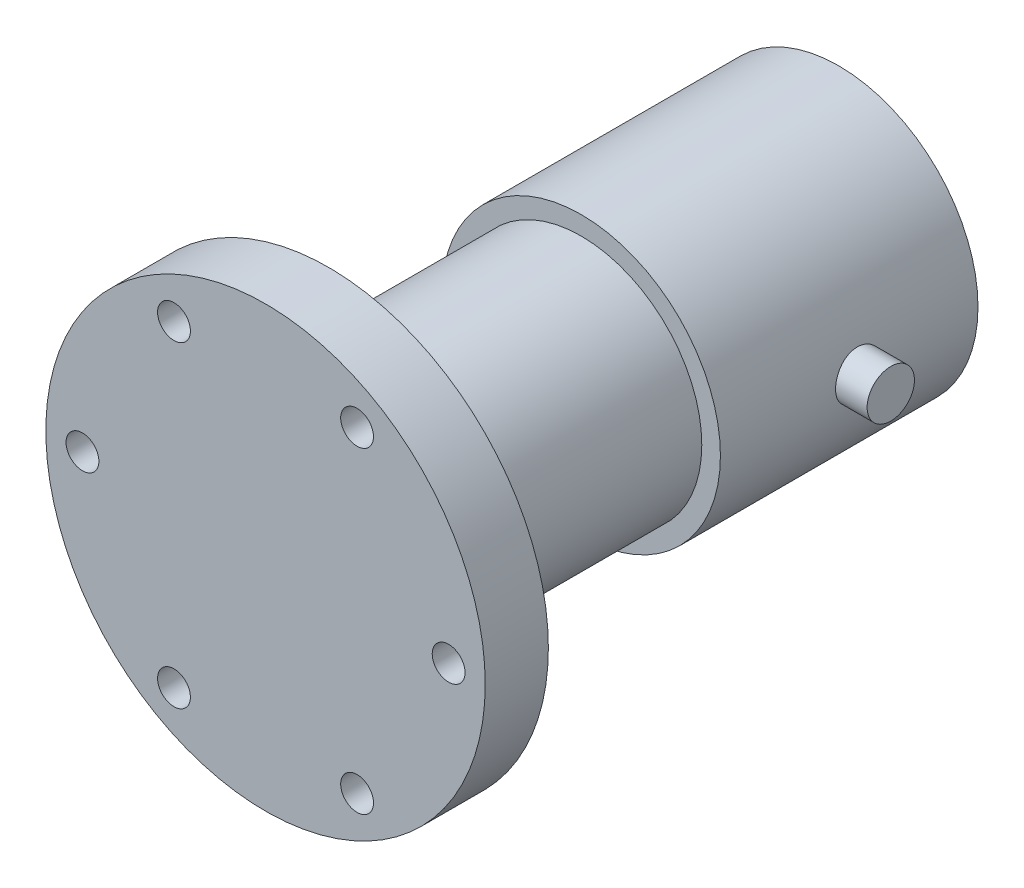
ISO-10303-21;
HEADER;
FILE_DESCRIPTION(('STEP AP214'),'2;1');
FILE_NAME('part.step','',(''),(''),'','','');
FILE_SCHEMA(('AUTOMOTIVE_DESIGN { 1 0 10303 214 1 1 1 1 }'));
ENDSEC;
DATA;
#1=APPLICATION_CONTEXT('core data for automotive mechanical design processes');
#2=APPLICATION_PROTOCOL_DEFINITION('international standard','automotive_design',2000,#1);
#3=PRODUCT_CONTEXT('',#1,'mechanical');
#4=PRODUCT('Part','Part','',(#3));
#5=PRODUCT_RELATED_PRODUCT_CATEGORY('part','',(#4));
#6=PRODUCT_DEFINITION_FORMATION('','',#4);
#7=PRODUCT_DEFINITION_CONTEXT('part definition',#1,'design');
#8=PRODUCT_DEFINITION('design','',#6,#7);
#9=PRODUCT_DEFINITION_SHAPE('','',#8);
#10=(LENGTH_UNIT() NAMED_UNIT(*) SI_UNIT(.MILLI.,.METRE.));
#11=(NAMED_UNIT(*) PLANE_ANGLE_UNIT() SI_UNIT($,.RADIAN.));
#12=(NAMED_UNIT(*) SI_UNIT($,.STERADIAN.) SOLID_ANGLE_UNIT());
#13=UNCERTAINTY_MEASURE_WITH_UNIT(LENGTH_MEASURE(1.E-05),#10,'distance_accuracy_value','');
#14=(GEOMETRIC_REPRESENTATION_CONTEXT(3) GLOBAL_UNCERTAINTY_ASSIGNED_CONTEXT((#13)) GLOBAL_UNIT_ASSIGNED_CONTEXT((#10,
#11,#12)) REPRESENTATION_CONTEXT('',''));
#15=CARTESIAN_POINT('',(0.,0.,0.));
#16=DIRECTION('',(0.,0.,1.));
#17=DIRECTION('',(1.,0.,0.));
#18=AXIS2_PLACEMENT_3D('',#15,#16,#17);
#19=CARTESIAN_POINT('',(0.,0.,-115.316));
#20=DIRECTION('',(0.,0.,1.));
#21=DIRECTION('',(-1.,0.,0.));
#22=AXIS2_PLACEMENT_3D('',#19,#20,#21);
#23=CYLINDRICAL_SURFACE('',#22,28.0035);
#24=CARTESIAN_POINT('',(0.,0.,-63.5));
#25=DIRECTION('',(0.,0.,1.));
#26=DIRECTION('',(1.,0.,0.));
#27=AXIS2_PLACEMENT_3D('',#24,#25,#26);
#28=CIRCLE('',#27,28.0035);
#29=CARTESIAN_POINT('',(28.0035,0.,-63.5));
#30=VERTEX_POINT('',#29);
#31=EDGE_CURVE('E47',#30,#30,#28,.T.);
#32=ORIENTED_EDGE('',*,*,#31,.F.);
#33=EDGE_LOOP('',(#32));
#34=FACE_BOUND('',#33,.T.);
#35=CARTESIAN_POINT('',(0.,0.,-115.316));
#36=DIRECTION('',(0.,0.,1.));
#37=DIRECTION('',(1.,0.,0.));
#38=AXIS2_PLACEMENT_3D('',#35,#36,#37);
#39=CIRCLE('',#38,28.0035);
#40=CARTESIAN_POINT('',(28.0035,0.,-115.316));
#41=VERTEX_POINT('',#40);
#42=EDGE_CURVE('E43',#41,#41,#39,.T.);
#43=ORIENTED_EDGE('',*,*,#42,.T.);
#44=EDGE_LOOP('',(#43));
#45=FACE_BOUND('',#44,.T.);
#46=CARTESIAN_POINT('',(28.0035,0.,-96.18472));
#47=CARTESIAN_POINT('',(28.003495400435,-0.265459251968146,-96.1847094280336));
#48=CARTESIAN_POINT('',(27.9996861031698,-0.531061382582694,-96.1624501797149));
#49=CARTESIAN_POINT('',(27.9848569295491,-1.054810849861,-96.0740414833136));
#50=CARTESIAN_POINT('',(27.9738305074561,-1.3129511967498,-96.0078521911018));
#51=CARTESIAN_POINT('',(27.9458033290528,-1.81412421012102,-95.8336442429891));
#52=CARTESIAN_POINT('',(27.9288075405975,-2.05716924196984,-95.725660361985));
#53=CARTESIAN_POINT('',(27.8907083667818,-2.52166170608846,-95.4710207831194));
#54=CARTESIAN_POINT('',(27.8696054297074,-2.74311149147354,-95.3243693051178));
#55=CARTESIAN_POINT('',(27.8253953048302,-3.16035756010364,-94.9950077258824));
#56=CARTESIAN_POINT('',(27.8022719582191,-3.35590812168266,-94.81198847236));
#57=CARTESIAN_POINT('',(27.7567502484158,-3.71368171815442,-94.4157519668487));
#58=CARTESIAN_POINT('',(27.7343519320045,-3.87590260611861,-94.2025327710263));
#59=CARTESIAN_POINT('',(27.6926597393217,-4.16340259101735,-93.7502533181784));
#60=CARTESIAN_POINT('',(27.6733867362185,-4.28843761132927,-93.5110358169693));
#61=CARTESIAN_POINT('',(27.6403520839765,-4.49645549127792,-93.014610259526));
#62=CARTESIAN_POINT('',(27.626590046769,-4.57944131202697,-92.7574034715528));
#63=CARTESIAN_POINT('',(27.6062966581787,-4.70022866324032,-92.2349091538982));
#64=CARTESIAN_POINT('',(27.5996973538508,-4.73845510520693,-91.969722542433));
#65=CARTESIAN_POINT('',(27.5942711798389,-4.76995626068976,-91.4366234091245));
#66=CARTESIAN_POINT('',(27.5954437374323,-4.76323428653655,-91.1687110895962));
#67=CARTESIAN_POINT('',(27.6053667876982,-4.70537528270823,-90.6408058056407));
#68=CARTESIAN_POINT('',(27.6140356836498,-4.65471648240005,-90.3807586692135));
#69=CARTESIAN_POINT('',(27.6378468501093,-4.51117275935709,-89.8729093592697));
#70=CARTESIAN_POINT('',(27.6529893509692,-4.4182863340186,-89.6251076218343));
#71=CARTESIAN_POINT('',(27.6881292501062,-4.19244189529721,-89.1473566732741));
#72=CARTESIAN_POINT('',(27.708150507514,-4.05928615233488,-88.9175027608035));
#73=CARTESIAN_POINT('',(27.7507755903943,-3.75682318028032,-88.4832197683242));
#74=CARTESIAN_POINT('',(27.7733796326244,-3.5875129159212,-88.2787928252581));
#75=CARTESIAN_POINT('',(27.8189814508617,-3.21494559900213,-87.8983992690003));
#76=CARTESIAN_POINT('',(27.8419805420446,-3.01127842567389,-87.72283424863));
#77=CARTESIAN_POINT('',(27.8855114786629,-2.57716340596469,-87.4083092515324));
#78=CARTESIAN_POINT('',(27.9060433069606,-2.34671537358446,-87.2693495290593));
#79=CARTESIAN_POINT('',(27.9423572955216,-1.86519619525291,-87.0319396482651));
#80=CARTESIAN_POINT('',(27.9581351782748,-1.61410673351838,-86.9335259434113));
#81=CARTESIAN_POINT('',(27.9831294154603,-1.09863444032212,-86.7803795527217));
#82=CARTESIAN_POINT('',(27.9923463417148,-0.834252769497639,-86.7256430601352));
#83=CARTESIAN_POINT('',(28.0031030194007,-0.30316124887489,-86.6619515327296));
#84=CARTESIAN_POINT('',(28.0047351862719,-0.036519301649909,-86.6524453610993));
#85=CARTESIAN_POINT('',(28.0003918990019,0.494546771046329,-86.6780135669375));
#86=CARTESIAN_POINT('',(27.9944167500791,0.758970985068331,-86.7130861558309));
#87=CARTESIAN_POINT('',(27.9755874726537,1.27638607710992,-86.8263579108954));
#88=CARTESIAN_POINT('',(27.9627770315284,1.52943862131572,-86.9042832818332));
#89=CARTESIAN_POINT('',(27.9317077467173,2.0188878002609,-87.1007560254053));
#90=CARTESIAN_POINT('',(27.9134485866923,2.25528346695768,-87.2193057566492));
#91=CARTESIAN_POINT('',(27.873277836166,2.70709595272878,-87.4949176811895));
#92=CARTESIAN_POINT('',(27.8513342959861,2.92230057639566,-87.6523229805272));
#93=CARTESIAN_POINT('',(27.8063228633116,3.32343785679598,-88.0007071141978));
#94=CARTESIAN_POINT('',(27.7832548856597,3.50936829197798,-88.1916884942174));
#95=CARTESIAN_POINT('',(27.7382944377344,3.84873029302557,-88.6042791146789));
#96=CARTESIAN_POINT('',(27.7164173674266,4.0017888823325,-88.8261970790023));
#97=CARTESIAN_POINT('',(27.6766067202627,4.2684548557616,-89.2929182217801));
#98=CARTESIAN_POINT('',(27.6586730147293,4.38206352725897,-89.5377206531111));
#99=CARTESIAN_POINT('',(27.6288960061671,4.56605138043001,-90.0422337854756));
#100=CARTESIAN_POINT('',(27.6170269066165,4.63661391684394,-90.3018760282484));
#101=CARTESIAN_POINT('',(27.6006591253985,4.73308183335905,-90.8295471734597));
#102=CARTESIAN_POINT('',(27.5961597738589,4.75899127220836,-91.0975753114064));
#103=CARTESIAN_POINT('',(27.5950706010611,4.7653007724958,-91.630683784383));
#104=CARTESIAN_POINT('',(27.5983787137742,4.74628809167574,-91.8957571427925));
#105=CARTESIAN_POINT('',(27.6123076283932,4.66456536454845,-92.418874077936));
#106=CARTESIAN_POINT('',(27.6229284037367,4.60185547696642,-92.6769176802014));
#107=CARTESIAN_POINT('',(27.6502465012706,4.43474704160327,-93.1784092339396));
#108=CARTESIAN_POINT('',(27.6669361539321,4.33040109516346,-93.4218751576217));
#109=CARTESIAN_POINT('',(27.7045185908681,4.08304341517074,-93.887940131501));
#110=CARTESIAN_POINT('',(27.7254115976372,3.94002963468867,-94.1105380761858));
#111=CARTESIAN_POINT('',(27.7693691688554,3.61730844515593,-94.531511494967));
#112=CARTESIAN_POINT('',(27.7924573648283,3.43716969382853,-94.7295538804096));
#113=CARTESIAN_POINT('',(27.8380172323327,3.0462202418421,-95.0927998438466));
#114=CARTESIAN_POINT('',(27.8604887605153,2.83540248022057,-95.2579958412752));
#115=CARTESIAN_POINT('',(27.9024718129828,2.38726724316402,-95.5519541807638));
#116=CARTESIAN_POINT('',(27.9219607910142,2.14976940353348,-95.680444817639));
#117=CARTESIAN_POINT('',(27.9555634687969,1.65632204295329,-95.8955066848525));
#118=CARTESIAN_POINT('',(27.969682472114,1.4003910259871,-95.9821192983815));
#119=CARTESIAN_POINT('',(27.9879045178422,0.952917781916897,-96.0923542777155));
#120=CARTESIAN_POINT('',(27.9937212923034,0.7640693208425,-96.1269353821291));
#121=CARTESIAN_POINT('',(28.0015206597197,0.383505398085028,-96.1731218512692));
#122=CARTESIAN_POINT('',(28.0035033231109,0.19178998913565,-96.1847276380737));
#123=CARTESIAN_POINT('',(28.0035,0.,-96.18472));
#124=B_SPLINE_CURVE_WITH_KNOTS('',3,(#46,#47,#48,#49,#50,#51,#52,#53,#54,#55,#56,#57,#58,#59,
#60,#61,#62,#63,#64,#65,#66,#67,#68,#69,#70,#71,#72,#73,#74,#75,#76,#77,#78,#79,#80,#81,#82,#83,
#84,#85,#86,#87,#88,#89,#90,#91,#92,#93,#94,#95,#96,#97,#98,#99,#100,#101,#102,#103,#104,#105,
#106,#107,#108,#109,#110,#111,#112,#113,#114,#115,#116,#117,#118,#119,#120,#121,#122,#123),
.UNSPECIFIED.,.T.,.F.,(4,2,2,2,2,2,2,2,2,2,2,2,2,2,2,2,2,2,2,2,2,2,2,2,2,2,2,2,2,2,2,2,2,2,2,2,
2,2,4),(0.,0.795676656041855,1.59207597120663,2.38781406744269,3.18346535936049,3.9861943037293,
4.78897493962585,5.59691403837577,6.40479623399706,7.20494517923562,8.00503516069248,
8.79652434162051,9.58804168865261,10.3835104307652,11.1790459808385,11.9848542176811,
12.7906680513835,13.5972047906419,14.4036712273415,15.2002851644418,15.996867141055,
16.788417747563,17.5800143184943,18.3788679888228,19.1777822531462,19.9853313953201,
20.7928541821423,21.5969128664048,22.4008984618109,23.1944319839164,23.9879626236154,
24.7804939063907,25.5730671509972,26.3754284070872,27.1779746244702,27.9863161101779,
28.7938571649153,29.3687311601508,29.9435945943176),.UNSPECIFIED.);
#125=CARTESIAN_POINT('',(28.0035,0.,-96.18472));
#126=VERTEX_POINT('',#125);
#127=EDGE_CURVE('E11',#126,#126,#124,.T.);
#128=ORIENTED_EDGE('',*,*,#127,.T.);
#129=EDGE_LOOP('',(#128));
#130=FACE_BOUND('',#129,.T.);
#131=ADVANCED_FACE('F33',(#34,#45,#130),#23,.T.);
#132=CARTESIAN_POINT('',(0.,0.,-115.316));
#133=DIRECTION('',(0.,0.,-1.));
#134=DIRECTION('',(1.,0.,0.));
#135=AXIS2_PLACEMENT_3D('',#132,#133,#134);
#136=PLANE('',#135);
#137=CARTESIAN_POINT('',(0.,0.,-115.316));
#138=DIRECTION('',(0.,0.,1.));
#139=DIRECTION('',(1.,0.,0.));
#140=AXIS2_PLACEMENT_3D('',#137,#138,#139);
#141=CIRCLE('',#140,22.5425);
#142=CARTESIAN_POINT('',(22.5425,0.,-115.316));
#143=VERTEX_POINT('',#142);
#144=EDGE_CURVE('E56',#143,#143,#141,.T.);
#145=ORIENTED_EDGE('',*,*,#144,.T.);
#146=EDGE_LOOP('',(#145));
#147=FACE_BOUND('',#146,.T.);
#148=ORIENTED_EDGE('',*,*,#42,.F.);
#149=EDGE_LOOP('',(#148));
#150=FACE_BOUND('',#149,.T.);
#151=ADVANCED_FACE('F78',(#147,#150),#136,.T.);
#152=CARTESIAN_POINT('',(0.,0.,-63.5));
#153=DIRECTION('',(0.,0.,-1.));
#154=DIRECTION('',(1.,0.,0.));
#155=AXIS2_PLACEMENT_3D('',#152,#153,#154);
#156=PLANE('',#155);
#157=CARTESIAN_POINT('',(0.,0.,-63.5));
#158=DIRECTION('',(0.,0.,1.));
#159=DIRECTION('',(1.,0.,0.));
#160=AXIS2_PLACEMENT_3D('',#157,#158,#159);
#161=CIRCLE('',#160,22.5425);
#162=CARTESIAN_POINT('',(22.5425,0.,-63.5));
#163=VERTEX_POINT('',#162);
#164=EDGE_CURVE('E52',#163,#163,#161,.T.);
#165=ORIENTED_EDGE('',*,*,#164,.F.);
#166=EDGE_LOOP('',(#165));
#167=FACE_BOUND('',#166,.T.);
#168=ORIENTED_EDGE('',*,*,#31,.T.);
#169=EDGE_LOOP('',(#168));
#170=FACE_BOUND('',#169,.T.);
#171=ADVANCED_FACE('F83',(#167,#170),#156,.F.);
#172=CARTESIAN_POINT('',(0.,0.,-61.976));
#173=DIRECTION('',(0.,0.,-1.));
#174=DIRECTION('',(1.,0.,0.));
#175=AXIS2_PLACEMENT_3D('',#172,#173,#174);
#176=CYLINDRICAL_SURFACE('',#175,22.5425);
#177=ORIENTED_EDGE('',*,*,#144,.F.);
#178=EDGE_LOOP('',(#177));
#179=FACE_BOUND('',#178,.T.);
#180=ORIENTED_EDGE('',*,*,#164,.T.);
#181=EDGE_LOOP('',(#180));
#182=FACE_BOUND('',#181,.T.);
#183=ADVANCED_FACE('F76',(#179,#182),#176,.F.);
#184=CARTESIAN_POINT('',(34.3535,0.,-91.42222));
#185=DIRECTION('',(-1.,0.,0.));
#186=DIRECTION('',(0.,0.,-1.));
#187=AXIS2_PLACEMENT_3D('',#184,#185,#186);
#188=CYLINDRICAL_SURFACE('',#187,4.7625);
#189=CARTESIAN_POINT('',(34.3535,0.,-91.42222));
#190=DIRECTION('',(-1.,0.,0.));
#191=DIRECTION('',(0.,0.,1.));
#192=AXIS2_PLACEMENT_3D('',#189,#190,#191);
#193=CIRCLE('',#192,4.7625);
#194=CARTESIAN_POINT('',(34.3535,0.,-86.65972));
#195=VERTEX_POINT('',#194);
#196=EDGE_CURVE('E60',#195,#195,#193,.T.);
#197=ORIENTED_EDGE('',*,*,#196,.T.);
#198=EDGE_LOOP('',(#197));
#199=FACE_BOUND('',#198,.T.);
#200=ORIENTED_EDGE('',*,*,#127,.F.);
#201=EDGE_LOOP('',(#200));
#202=FACE_BOUND('',#201,.T.);
#203=ADVANCED_FACE('F67',(#199,#202),#188,.T.);
#204=CARTESIAN_POINT('',(34.3535,0.,-91.42222));
#205=DIRECTION('',(1.,0.,0.));
#206=DIRECTION('',(0.,0.,1.));
#207=AXIS2_PLACEMENT_3D('',#204,#205,#206);
#208=PLANE('',#207);
#209=ORIENTED_EDGE('',*,*,#196,.F.);
#210=EDGE_LOOP('',(#209));
#211=FACE_BOUND('',#210,.T.);
#212=ADVANCED_FACE('F70',(#211),#208,.T.);
#213=CLOSED_SHELL('',(#131,#151,#171,#183,#203,#212));
#214=MANIFOLD_SOLID_BREP('B2',#213);
#215=CARTESIAN_POINT('',(0.,0.,-12.7));
#216=DIRECTION('',(0.,0.,1.));
#217=DIRECTION('',(-1.,0.,0.));
#218=AXIS2_PLACEMENT_3D('',#215,#216,#217);
#219=CYLINDRICAL_SURFACE('',#218,44.196);
#220=CARTESIAN_POINT('',(0.,0.,-12.7));
#221=DIRECTION('',(0.,0.,1.));
#222=DIRECTION('',(1.,0.,0.));
#223=AXIS2_PLACEMENT_3D('',#220,#221,#222);
#224=CIRCLE('',#223,44.196);
#225=CARTESIAN_POINT('',(44.196,0.,-12.7));
#226=VERTEX_POINT('',#225);
#227=EDGE_CURVE('E32',#226,#226,#224,.T.);
#228=ORIENTED_EDGE('',*,*,#227,.T.);
#229=EDGE_LOOP('',(#228));
#230=FACE_BOUND('',#229,.T.);
#231=CARTESIAN_POINT('',(0.,0.,0.));
#232=DIRECTION('',(0.,0.,1.));
#233=DIRECTION('',(1.,0.,0.));
#234=AXIS2_PLACEMENT_3D('',#231,#232,#233);
#235=CIRCLE('',#234,44.196);
#236=CARTESIAN_POINT('',(44.196,0.,0.));
#237=VERTEX_POINT('',#236);
#238=EDGE_CURVE('E129',#237,#237,#235,.T.);
#239=ORIENTED_EDGE('',*,*,#238,.F.);
#240=EDGE_LOOP('',(#239));
#241=FACE_BOUND('',#240,.T.);
#242=ADVANCED_FACE('F123',(#230,#241),#219,.T.);
#243=CARTESIAN_POINT('',(0.,0.,-12.7));
#244=DIRECTION('',(0.,0.,-1.));
#245=DIRECTION('',(1.,0.,0.));
#246=AXIS2_PLACEMENT_3D('',#243,#244,#245);
#247=PLANE('',#246);
#248=CARTESIAN_POINT('',(18.4150000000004,31.8957156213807,-12.7));
#249=DIRECTION('',(0.,0.,-1.));
#250=DIRECTION('',(-0.50000000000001,-0.866025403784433,0.));
#251=AXIS2_PLACEMENT_3D('',#248,#249,#250);
#252=CIRCLE('',#251,3.302);
#253=CARTESIAN_POINT('',(16.7640000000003,29.0360997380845,-12.7));
#254=VERTEX_POINT('',#253);
#255=EDGE_CURVE('E166',#254,#254,#252,.T.);
#256=ORIENTED_EDGE('',*,*,#255,.F.);
#257=EDGE_LOOP('',(#256));
#258=FACE_BOUND('',#257,.T.);
#259=CARTESIAN_POINT('',(-18.4149999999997,31.895715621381,-12.7));
#260=DIRECTION('',(0.,0.,-1.));
#261=DIRECTION('',(0.499999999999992,-0.866025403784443,0.));
#262=AXIS2_PLACEMENT_3D('',#259,#260,#261);
#263=CIRCLE('',#262,3.302);
#264=CARTESIAN_POINT('',(-16.7639999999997,29.0360997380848,-12.7));
#265=VERTEX_POINT('',#264);
#266=EDGE_CURVE('E160',#265,#265,#263,.T.);
#267=ORIENTED_EDGE('',*,*,#266,.F.);
#268=EDGE_LOOP('',(#267));
#269=FACE_BOUND('',#268,.T.);
#270=CARTESIAN_POINT('',(-36.83,2.57182664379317E-13,-12.7));
#271=DIRECTION('',(0.,0.,-1.));
#272=DIRECTION('',(1.,0.,0.));
#273=AXIS2_PLACEMENT_3D('',#270,#271,#272);
#274=CIRCLE('',#273,3.302);
#275=CARTESIAN_POINT('',(-33.528,2.34124908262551E-13,-12.7));
#276=VERTEX_POINT('',#275);
#277=EDGE_CURVE('E154',#276,#276,#274,.T.);
#278=ORIENTED_EDGE('',*,*,#277,.F.);
#279=EDGE_LOOP('',(#278));
#280=FACE_BOUND('',#279,.T.);
#281=CARTESIAN_POINT('',(-18.4150000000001,-31.8957156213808,-12.7));
#282=DIRECTION('',(0.,0.,-1.));
#283=DIRECTION('',(0.500000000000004,0.866025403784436,0.));
#284=AXIS2_PLACEMENT_3D('',#281,#282,#283);
#285=CIRCLE('',#284,3.302);
#286=CARTESIAN_POINT('',(-16.7640000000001,-29.0360997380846,-12.7));
#287=VERTEX_POINT('',#286);
#288=EDGE_CURVE('E148',#287,#287,#285,.T.);
#289=ORIENTED_EDGE('',*,*,#288,.F.);
#290=EDGE_LOOP('',(#289));
#291=FACE_BOUND('',#290,.T.);
#292=CARTESIAN_POINT('',(18.4149999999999,-31.8957156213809,-12.7));
#293=DIRECTION('',(0.,0.,-1.));
#294=DIRECTION('',(-0.499999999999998,0.86602540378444,0.));
#295=AXIS2_PLACEMENT_3D('',#292,#293,#294);
#296=CIRCLE('',#295,3.302);
#297=CARTESIAN_POINT('',(16.7639999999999,-29.0360997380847,-12.7));
#298=VERTEX_POINT('',#297);
#299=EDGE_CURVE('E142',#298,#298,#296,.T.);
#300=ORIENTED_EDGE('',*,*,#299,.F.);
#301=EDGE_LOOP('',(#300));
#302=FACE_BOUND('',#301,.T.);
#303=CARTESIAN_POINT('',(36.83,0.,-12.7));
#304=DIRECTION('',(0.,0.,1.));
#305=DIRECTION('',(1.,0.,0.));
#306=AXIS2_PLACEMENT_3D('',#303,#304,#305);
#307=CIRCLE('',#306,3.302);
#308=CARTESIAN_POINT('',(33.528,0.,-12.7));
#309=VERTEX_POINT('',#308);
#310=EDGE_CURVE('E133',#309,#309,#307,.T.);
#311=ORIENTED_EDGE('',*,*,#310,.T.);
#312=EDGE_LOOP('',(#311));
#313=FACE_BOUND('',#312,.T.);
#314=ORIENTED_EDGE('',*,*,#227,.F.);
#315=EDGE_LOOP('',(#314));
#316=FACE_BOUND('',#315,.T.);
#317=ADVANCED_FACE('F188',(#258,#269,#280,#291,#302,#313,#316),#247,.T.);
#318=CARTESIAN_POINT('',(0.,0.,0.));
#319=DIRECTION('',(0.,0.,-1.));
#320=DIRECTION('',(1.,0.,0.));
#321=AXIS2_PLACEMENT_3D('',#318,#319,#320);
#322=PLANE('',#321);
#323=CARTESIAN_POINT('',(18.4150000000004,31.8957156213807,0.));
#324=DIRECTION('',(0.,0.,-1.));
#325=DIRECTION('',(-0.50000000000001,-0.866025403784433,0.));
#326=AXIS2_PLACEMENT_3D('',#323,#324,#325);
#327=CIRCLE('',#326,3.302);
#328=CARTESIAN_POINT('',(16.7640000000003,29.0360997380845,0.));
#329=VERTEX_POINT('',#328);
#330=EDGE_CURVE('E169',#329,#329,#327,.T.);
#331=ORIENTED_EDGE('',*,*,#330,.T.);
#332=EDGE_LOOP('',(#331));
#333=FACE_BOUND('',#332,.T.);
#334=CARTESIAN_POINT('',(-18.4149999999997,31.895715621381,0.));
#335=DIRECTION('',(0.,0.,-1.));
#336=DIRECTION('',(0.499999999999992,-0.866025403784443,0.));
#337=AXIS2_PLACEMENT_3D('',#334,#335,#336);
#338=CIRCLE('',#337,3.302);
#339=CARTESIAN_POINT('',(-16.7639999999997,29.0360997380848,0.));
#340=VERTEX_POINT('',#339);
#341=EDGE_CURVE('E163',#340,#340,#338,.T.);
#342=ORIENTED_EDGE('',*,*,#341,.T.);
#343=EDGE_LOOP('',(#342));
#344=FACE_BOUND('',#343,.T.);
#345=CARTESIAN_POINT('',(-36.83,2.57182664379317E-13,0.));
#346=DIRECTION('',(0.,0.,-1.));
#347=DIRECTION('',(1.,0.,0.));
#348=AXIS2_PLACEMENT_3D('',#345,#346,#347);
#349=CIRCLE('',#348,3.302);
#350=CARTESIAN_POINT('',(-33.528,2.34124908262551E-13,0.));
#351=VERTEX_POINT('',#350);
#352=EDGE_CURVE('E157',#351,#351,#349,.T.);
#353=ORIENTED_EDGE('',*,*,#352,.T.);
#354=EDGE_LOOP('',(#353));
#355=FACE_BOUND('',#354,.T.);
#356=CARTESIAN_POINT('',(-18.4150000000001,-31.8957156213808,0.));
#357=DIRECTION('',(0.,0.,-1.));
#358=DIRECTION('',(0.500000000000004,0.866025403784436,0.));
#359=AXIS2_PLACEMENT_3D('',#356,#357,#358);
#360=CIRCLE('',#359,3.302);
#361=CARTESIAN_POINT('',(-16.7640000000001,-29.0360997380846,0.));
#362=VERTEX_POINT('',#361);
#363=EDGE_CURVE('E151',#362,#362,#360,.T.);
#364=ORIENTED_EDGE('',*,*,#363,.T.);
#365=EDGE_LOOP('',(#364));
#366=FACE_BOUND('',#365,.T.);
#367=CARTESIAN_POINT('',(18.4149999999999,-31.8957156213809,0.));
#368=DIRECTION('',(0.,0.,-1.));
#369=DIRECTION('',(-0.499999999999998,0.86602540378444,0.));
#370=AXIS2_PLACEMENT_3D('',#367,#368,#369);
#371=CIRCLE('',#370,3.302);
#372=CARTESIAN_POINT('',(16.7639999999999,-29.0360997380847,0.));
#373=VERTEX_POINT('',#372);
#374=EDGE_CURVE('E145',#373,#373,#371,.T.);
#375=ORIENTED_EDGE('',*,*,#374,.T.);
#376=EDGE_LOOP('',(#375));
#377=FACE_BOUND('',#376,.T.);
#378=CARTESIAN_POINT('',(36.83,0.,0.));
#379=DIRECTION('',(0.,0.,-1.));
#380=DIRECTION('',(-1.,0.,0.));
#381=AXIS2_PLACEMENT_3D('',#378,#379,#380);
#382=CIRCLE('',#381,3.302);
#383=CARTESIAN_POINT('',(33.528,0.,0.));
#384=VERTEX_POINT('',#383);
#385=EDGE_CURVE('E137',#384,#384,#382,.T.);
#386=ORIENTED_EDGE('',*,*,#385,.T.);
#387=EDGE_LOOP('',(#386));
#388=FACE_BOUND('',#387,.T.);
#389=ORIENTED_EDGE('',*,*,#238,.T.);
#390=EDGE_LOOP('',(#389));
#391=FACE_BOUND('',#390,.T.);
#392=ADVANCED_FACE('F173',(#333,#344,#355,#366,#377,#388,#391),#322,.F.);
#393=CARTESIAN_POINT('',(36.83,0.,-115.316));
#394=DIRECTION('',(0.,0.,1.));
#395=DIRECTION('',(-1.,0.,0.));
#396=AXIS2_PLACEMENT_3D('',#393,#394,#395);
#397=CYLINDRICAL_SURFACE('',#396,3.302);
#398=CARTESIAN_POINT('',(33.528,0.,-12.7));
#399=CARTESIAN_POINT('',(33.528,0.,-12.5677083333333));
#400=CARTESIAN_POINT('',(33.528,0.,-12.4354166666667));
#401=CARTESIAN_POINT('',(33.528,0.,-12.1708333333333));
#402=CARTESIAN_POINT('',(33.528,0.,-12.0385416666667));
#403=CARTESIAN_POINT('',(33.528,0.,-11.7739583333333));
#404=CARTESIAN_POINT('',(33.528,0.,-11.6416666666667));
#405=CARTESIAN_POINT('',(33.528,0.,-11.3770833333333));
#406=CARTESIAN_POINT('',(33.528,0.,-11.2447916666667));
#407=CARTESIAN_POINT('',(33.528,0.,-10.9802083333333));
#408=CARTESIAN_POINT('',(33.528,0.,-10.8479166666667));
#409=CARTESIAN_POINT('',(33.528,0.,-10.5833333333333));
#410=CARTESIAN_POINT('',(33.528,0.,-10.4510416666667));
#411=CARTESIAN_POINT('',(33.528,0.,-10.1864583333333));
#412=CARTESIAN_POINT('',(33.528,0.,-10.0541666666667));
#413=CARTESIAN_POINT('',(33.528,0.,-9.78958333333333));
#414=CARTESIAN_POINT('',(33.528,0.,-9.65729166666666));
#415=CARTESIAN_POINT('',(33.528,0.,-9.39270833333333));
#416=CARTESIAN_POINT('',(33.528,0.,-9.26041666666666));
#417=CARTESIAN_POINT('',(33.528,0.,-8.99583333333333));
#418=CARTESIAN_POINT('',(33.528,0.,-8.86354166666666));
#419=CARTESIAN_POINT('',(33.528,0.,-8.59895833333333));
#420=CARTESIAN_POINT('',(33.528,0.,-8.46666666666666));
#421=CARTESIAN_POINT('',(33.528,0.,-8.20208333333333));
#422=CARTESIAN_POINT('',(33.528,0.,-8.06979166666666));
#423=CARTESIAN_POINT('',(33.528,0.,-7.80520833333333));
#424=CARTESIAN_POINT('',(33.528,0.,-7.67291666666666));
#425=CARTESIAN_POINT('',(33.528,0.,-7.40833333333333));
#426=CARTESIAN_POINT('',(33.528,0.,-7.27604166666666));
#427=CARTESIAN_POINT('',(33.528,0.,-7.01145833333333));
#428=CARTESIAN_POINT('',(33.528,0.,-6.87916666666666));
#429=CARTESIAN_POINT('',(33.528,0.,-6.61458333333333));
#430=CARTESIAN_POINT('',(33.528,0.,-6.48229166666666));
#431=CARTESIAN_POINT('',(33.528,0.,-6.21770833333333));
#432=CARTESIAN_POINT('',(33.528,0.,-6.08541666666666));
#433=CARTESIAN_POINT('',(33.528,0.,-5.82083333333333));
#434=CARTESIAN_POINT('',(33.528,0.,-5.68854166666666));
#435=CARTESIAN_POINT('',(33.528,0.,-5.42395833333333));
#436=CARTESIAN_POINT('',(33.528,0.,-5.29166666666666));
#437=CARTESIAN_POINT('',(33.528,0.,-5.02708333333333));
#438=CARTESIAN_POINT('',(33.528,0.,-4.89479166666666));
#439=CARTESIAN_POINT('',(33.528,0.,-4.63020833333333));
#440=CARTESIAN_POINT('',(33.528,0.,-4.49791666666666));
#441=CARTESIAN_POINT('',(33.528,0.,-4.23333333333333));
#442=CARTESIAN_POINT('',(33.528,0.,-4.10104166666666));
#443=CARTESIAN_POINT('',(33.528,0.,-3.83645833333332));
#444=CARTESIAN_POINT('',(33.528,0.,-3.70416666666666));
#445=CARTESIAN_POINT('',(33.528,0.,-3.43958333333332));
#446=CARTESIAN_POINT('',(33.528,0.,-3.30729166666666));
#447=CARTESIAN_POINT('',(33.528,0.,-3.04270833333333));
#448=CARTESIAN_POINT('',(33.528,0.,-2.91041666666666));
#449=CARTESIAN_POINT('',(33.528,0.,-2.64583333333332));
#450=CARTESIAN_POINT('',(33.528,0.,-2.51354166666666));
#451=CARTESIAN_POINT('',(33.528,0.,-2.24895833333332));
#452=CARTESIAN_POINT('',(33.528,0.,-2.11666666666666));
#453=CARTESIAN_POINT('',(33.528,0.,-1.85208333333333));
#454=CARTESIAN_POINT('',(33.528,0.,-1.71979166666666));
#455=CARTESIAN_POINT('',(33.528,0.,-1.45520833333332));
#456=CARTESIAN_POINT('',(33.528,0.,-1.32291666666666));
#457=CARTESIAN_POINT('',(33.528,0.,-1.05833333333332));
#458=CARTESIAN_POINT('',(33.528,0.,-0.92604166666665));
#459=CARTESIAN_POINT('',(33.528,0.,-0.661458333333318));
#460=CARTESIAN_POINT('',(33.528,0.,-0.529166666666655));
#461=CARTESIAN_POINT('',(33.528,0.,-0.264583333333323));
#462=CARTESIAN_POINT('',(33.528,0.,-0.132291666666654));
#463=CARTESIAN_POINT('',(33.528,0.,0.));
#464=B_SPLINE_CURVE_WITH_KNOTS('',3,(#398,#399,#400,#401,#402,#403,#404,#405,#406,#407,#408,
#409,#410,#411,#412,#413,#414,#415,#416,#417,#418,#419,#420,#421,#422,#423,#424,#425,#426,#427,
#428,#429,#430,#431,#432,#433,#434,#435,#436,#437,#438,#439,#440,#441,#442,#443,#444,#445,#446,
#447,#448,#449,#450,#451,#452,#453,#454,#455,#456,#457,#458,#459,#460,#461,#462,#463),
.UNSPECIFIED.,.F.,.F.,(4,2,2,2,2,2,2,2,2,2,2,2,2,2,2,2,2,2,2,2,2,2,2,2,2,2,2,2,2,2,2,2,4),(0.,
0.396875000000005,0.793749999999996,1.190625,1.58750000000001,1.984375,2.38125,2.77812500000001,
3.17500000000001,3.571875,3.96875000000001,4.36562500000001,4.7625,5.15937500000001,
5.55625000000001,5.953125,6.35000000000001,6.74687500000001,7.14375,7.54062500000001,
7.93750000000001,8.334375,8.73125000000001,9.12812500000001,9.52500000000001,9.92187500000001,
10.31875,10.715625,11.1125,11.509375,11.90625,12.303125,12.7),.UNSPECIFIED.);
#465=EDGE_CURVE('BSEAM197',#309,#384,#464,.T.);
#466=ORIENTED_EDGE('',*,*,#310,.F.);
#467=ORIENTED_EDGE('',*,*,#385,.F.);
#468=ORIENTED_EDGE('',*,*,#465,.T.);
#469=ORIENTED_EDGE('',*,*,#465,.F.);
#470=EDGE_LOOP('',(#466,#468,#467,#469));
#471=FACE_BOUND('',#470,.T.);
#472=ADVANCED_FACE('F197',(#471),#397,.F.);
#473=CARTESIAN_POINT('',(18.4149999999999,-31.8957156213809,-12.7));
#474=DIRECTION('',(0.,0.,1.));
#475=DIRECTION('',(-1.,0.,0.));
#476=AXIS2_PLACEMENT_3D('',#473,#474,#475);
#477=CYLINDRICAL_SURFACE('',#476,3.302);
#478=ORIENTED_EDGE('',*,*,#299,.T.);
#479=EDGE_LOOP('',(#478));
#480=FACE_BOUND('',#479,.T.);
#481=ORIENTED_EDGE('',*,*,#374,.F.);
#482=EDGE_LOOP('',(#481));
#483=FACE_BOUND('',#482,.T.);
#484=ADVANCED_FACE('F204',(#480,#483),#477,.F.);
#485=CARTESIAN_POINT('',(-18.4150000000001,-31.8957156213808,-12.7));
#486=DIRECTION('',(0.,0.,1.));
#487=DIRECTION('',(-1.,0.,0.));
#488=AXIS2_PLACEMENT_3D('',#485,#486,#487);
#489=CYLINDRICAL_SURFACE('',#488,3.302);
#490=ORIENTED_EDGE('',*,*,#288,.T.);
#491=EDGE_LOOP('',(#490));
#492=FACE_BOUND('',#491,.T.);
#493=ORIENTED_EDGE('',*,*,#363,.F.);
#494=EDGE_LOOP('',(#493));
#495=FACE_BOUND('',#494,.T.);
#496=ADVANCED_FACE('F208',(#492,#495),#489,.F.);
#497=CARTESIAN_POINT('',(-36.83,2.57182664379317E-13,-12.7));
#498=DIRECTION('',(0.,0.,1.));
#499=DIRECTION('',(-1.,0.,0.));
#500=AXIS2_PLACEMENT_3D('',#497,#498,#499);
#501=CYLINDRICAL_SURFACE('',#500,3.302);
#502=ORIENTED_EDGE('',*,*,#277,.T.);
#503=EDGE_LOOP('',(#502));
#504=FACE_BOUND('',#503,.T.);
#505=ORIENTED_EDGE('',*,*,#352,.F.);
#506=EDGE_LOOP('',(#505));
#507=FACE_BOUND('',#506,.T.);
#508=ADVANCED_FACE('F184',(#504,#507),#501,.F.);
#509=CARTESIAN_POINT('',(-18.4149999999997,31.895715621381,-12.7));
#510=DIRECTION('',(0.,0.,1.));
#511=DIRECTION('',(-1.,0.,0.));
#512=AXIS2_PLACEMENT_3D('',#509,#510,#511);
#513=CYLINDRICAL_SURFACE('',#512,3.302);
#514=ORIENTED_EDGE('',*,*,#266,.T.);
#515=EDGE_LOOP('',(#514));
#516=FACE_BOUND('',#515,.T.);
#517=ORIENTED_EDGE('',*,*,#341,.F.);
#518=EDGE_LOOP('',(#517));
#519=FACE_BOUND('',#518,.T.);
#520=ADVANCED_FACE('F178',(#516,#519),#513,.F.);
#521=CARTESIAN_POINT('',(18.4150000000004,31.8957156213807,-12.7));
#522=DIRECTION('',(0.,0.,1.));
#523=DIRECTION('',(-1.,0.,0.));
#524=AXIS2_PLACEMENT_3D('',#521,#522,#523);
#525=CYLINDRICAL_SURFACE('',#524,3.302);
#526=ORIENTED_EDGE('',*,*,#255,.T.);
#527=EDGE_LOOP('',(#526));
#528=FACE_BOUND('',#527,.T.);
#529=ORIENTED_EDGE('',*,*,#330,.F.);
#530=EDGE_LOOP('',(#529));
#531=FACE_BOUND('',#530,.T.);
#532=ADVANCED_FACE('F176',(#528,#531),#525,.F.);
#533=CLOSED_SHELL('',(#242,#317,#392,#472,#484,#496,#508,#520,#532));
#534=MANIFOLD_SOLID_BREP('B6',#533);
#535=CARTESIAN_POINT('',(0.,0.,-63.5));
#536=DIRECTION('',(0.,0.,1.));
#537=DIRECTION('',(-1.,0.,0.));
#538=AXIS2_PLACEMENT_3D('',#535,#536,#537);
#539=CYLINDRICAL_SURFACE('',#538,24.257);
#540=CARTESIAN_POINT('',(0.,0.,-63.5));
#541=DIRECTION('',(0.,0.,1.));
#542=DIRECTION('',(1.,0.,0.));
#543=AXIS2_PLACEMENT_3D('',#540,#541,#542);
#544=CIRCLE('',#543,24.257);
#545=CARTESIAN_POINT('',(24.257,0.,-63.5));
#546=VERTEX_POINT('',#545);
#547=EDGE_CURVE('E122',#546,#546,#544,.T.);
#548=ORIENTED_EDGE('',*,*,#547,.T.);
#549=EDGE_LOOP('',(#548));
#550=FACE_BOUND('',#549,.T.);
#551=CARTESIAN_POINT('',(0.,0.,-12.7));
#552=DIRECTION('',(0.,0.,1.));
#553=DIRECTION('',(1.,0.,0.));
#554=AXIS2_PLACEMENT_3D('',#551,#552,#553);
#555=CIRCLE('',#554,24.257);
#556=CARTESIAN_POINT('',(24.257,0.,-12.7));
#557=VERTEX_POINT('',#556);
#558=EDGE_CURVE('E278',#557,#557,#555,.T.);
#559=ORIENTED_EDGE('',*,*,#558,.F.);
#560=EDGE_LOOP('',(#559));
#561=FACE_BOUND('',#560,.T.);
#562=ADVANCED_FACE('F271',(#550,#561),#539,.T.);
#563=CARTESIAN_POINT('',(0.,0.,-63.5));
#564=DIRECTION('',(0.,0.,-1.));
#565=DIRECTION('',(1.,0.,0.));
#566=AXIS2_PLACEMENT_3D('',#563,#564,#565);
#567=PLANE('',#566);
#568=CARTESIAN_POINT('',(0.,0.,-63.5));
#569=DIRECTION('',(0.,0.,1.));
#570=DIRECTION('',(1.,0.,0.));
#571=AXIS2_PLACEMENT_3D('',#568,#569,#570);
#572=CIRCLE('',#571,22.5425);
#573=CARTESIAN_POINT('',(22.5425,0.,-63.5));
#574=VERTEX_POINT('',#573);
#575=EDGE_CURVE('E274',#574,#574,#572,.T.);
#576=ORIENTED_EDGE('',*,*,#575,.T.);
#577=EDGE_LOOP('',(#576));
#578=FACE_BOUND('',#577,.T.);
#579=ORIENTED_EDGE('',*,*,#547,.F.);
#580=EDGE_LOOP('',(#579));
#581=FACE_BOUND('',#580,.T.);
#582=ADVANCED_FACE('F291',(#578,#581),#567,.T.);
#583=CARTESIAN_POINT('',(0.,0.,-12.7));
#584=DIRECTION('',(0.,0.,-1.));
#585=DIRECTION('',(1.,0.,0.));
#586=AXIS2_PLACEMENT_3D('',#583,#584,#585);
#587=PLANE('',#586);
#588=ORIENTED_EDGE('',*,*,#558,.T.);
#589=EDGE_LOOP('',(#588));
#590=FACE_BOUND('',#589,.T.);
#591=ADVANCED_FACE('F297',(#590),#587,.F.);
#592=CARTESIAN_POINT('',(0.,0.,-61.976));
#593=DIRECTION('',(0.,0.,-1.));
#594=DIRECTION('',(1.,0.,0.));
#595=AXIS2_PLACEMENT_3D('',#592,#593,#594);
#596=CYLINDRICAL_SURFACE('',#595,22.5425);
#597=ORIENTED_EDGE('',*,*,#575,.F.);
#598=EDGE_LOOP('',(#597));
#599=FACE_BOUND('',#598,.T.);
#600=CARTESIAN_POINT('',(0.,0.,-61.976));
#601=DIRECTION('',(0.,0.,1.));
#602=DIRECTION('',(1.,0.,0.));
#603=AXIS2_PLACEMENT_3D('',#600,#601,#602);
#604=CIRCLE('',#603,22.5425);
#605=CARTESIAN_POINT('',(22.5425,0.,-61.976));
#606=VERTEX_POINT('',#605);
#607=EDGE_CURVE('E284',#606,#606,#604,.T.);
#608=ORIENTED_EDGE('',*,*,#607,.T.);
#609=EDGE_LOOP('',(#608));
#610=FACE_BOUND('',#609,.T.);
#611=ADVANCED_FACE('F294',(#599,#610),#596,.F.);
#612=CARTESIAN_POINT('',(0.,0.,-61.976));
#613=DIRECTION('',(0.,0.,-1.));
#614=DIRECTION('',(1.,0.,0.));
#615=AXIS2_PLACEMENT_3D('',#612,#613,#614);
#616=PLANE('',#615);
#617=ORIENTED_EDGE('',*,*,#607,.F.);
#618=EDGE_LOOP('',(#617));
#619=FACE_BOUND('',#618,.T.);
#620=ADVANCED_FACE('F296',(#619),#616,.T.);
#621=CLOSED_SHELL('',(#562,#582,#591,#611,#620));
#622=MANIFOLD_SOLID_BREP('B27',#621);
#623=ADVANCED_BREP_SHAPE_REPRESENTATION('',(#18,#214,#534,#622),#14);
#624=SHAPE_DEFINITION_REPRESENTATION(#9,#623);
ENDSEC;
END-ISO-10303-21;
